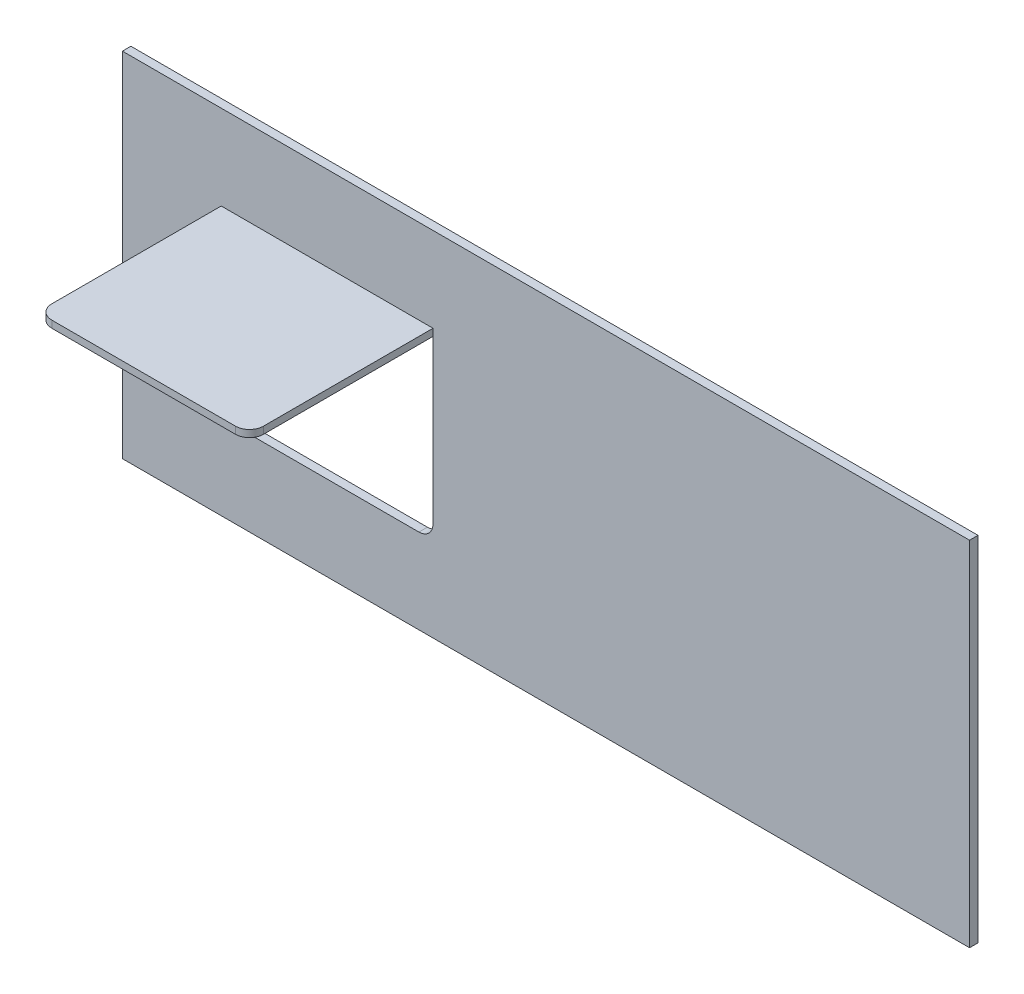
from build123d import *

# Parameters (mm, degrees)
ESBO_O1_W                = 600
ESBO_O1_H                = 250
RESSALTO_EXTRUS_O1_DEPTH = 6
ESBO_O7_W                = 150
ESBO_O7_H                = 130
CORTE_EXTRUS_O6_DEPTH    = 215
ESBO_O8_W                = 150
ESBO_O8_H                = 130
RESSALTO_EXTRUS_O2_DEPTH = 5
FILETE5_R                = 10
FILETE6_R                = 10
FILETE7_R                = 10
FILETE8_R                = 10


with BuildPart() as part:
    # Esbo_o1 → Ressalto-extrus_o1 (new body)
    with BuildSketch(Plane.XY):
        with Locations((300, -125)):
            Rectangle(ESBO_O1_W, ESBO_O1_H)
    extrude(amount=RESSALTO_EXTRUS_O1_DEPTH)

    # Esbo_o7 → Corte-extrus_o6 (cut)
    with BuildSketch(Plane.XY.offset(6)):
        with Locations((145, -125)):
            Rectangle(ESBO_O7_W, ESBO_O7_H)
    extrude(amount=-CORTE_EXTRUS_O6_DEPTH, mode=Mode.SUBTRACT)

    # Filete5
    filete5_edges = [part.edges().sort_by_distance(p)[0] for p in [
        (70, -190, 3),
    ]]
    fillet(filete5_edges, radius=FILETE5_R)

    # Filete6
    filete6_edges = [part.edges().sort_by_distance(p)[0] for p in [
        (220, -190, 3),
    ]]
    fillet(filete6_edges, radius=FILETE6_R)


with BuildPart() as body_2:
    # Esbo_o8 → Ressalto-extrus_o2 (new body)
    with BuildSketch(Plane.XZ.offset(60)):
        with Locations((145, 71)):
            Rectangle(ESBO_O8_W, ESBO_O8_H)
    extrude(amount=RESSALTO_EXTRUS_O2_DEPTH)

    # Filete7
    filete7_edges = [body_2.edges().sort_by_distance(p)[0] for p in [
        (220, -62.5, 136),
    ]]
    fillet(filete7_edges, radius=FILETE7_R)

    # Filete8
    filete8_edges = [body_2.edges().sort_by_distance(p)[0] for p in [
        (70, -62.5, 136),
    ]]
    fillet(filete8_edges, radius=FILETE8_R)


solid = Compound([part.part, body_2.part])
